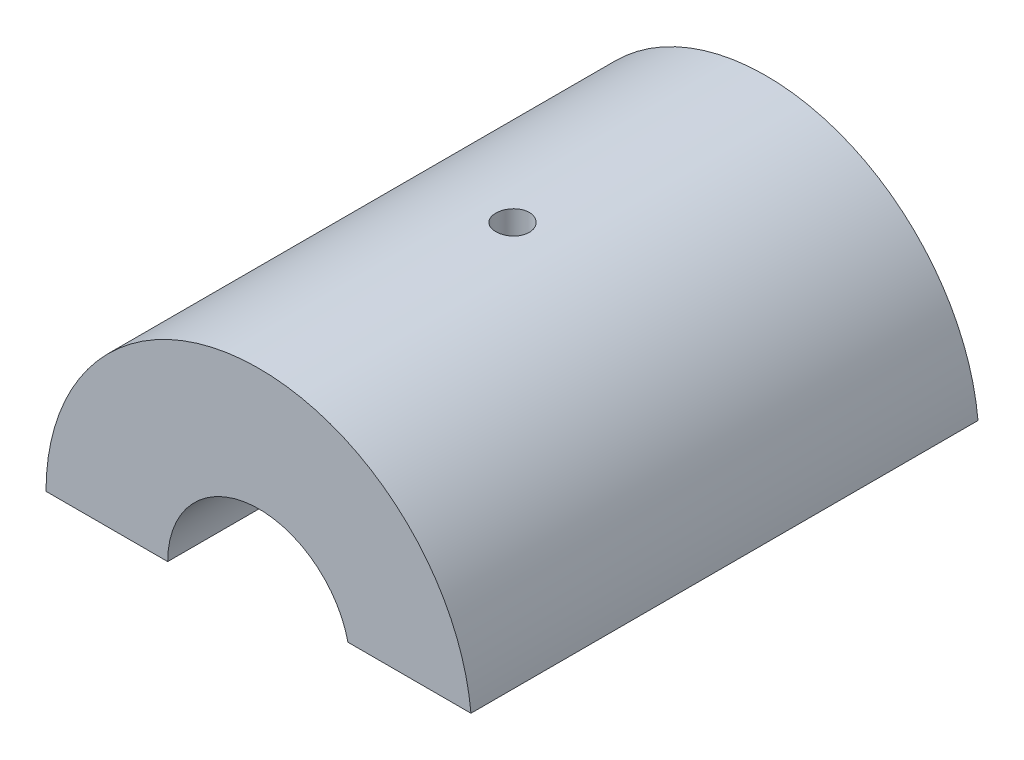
ISO-10303-21;
HEADER;
FILE_DESCRIPTION(('STEP AP214'),'2;1');
FILE_NAME('part.step','',(''),(''),'','','');
FILE_SCHEMA(('AUTOMOTIVE_DESIGN { 1 0 10303 214 1 1 1 1 }'));
ENDSEC;
DATA;
#1=APPLICATION_CONTEXT('core data for automotive mechanical design processes');
#2=APPLICATION_PROTOCOL_DEFINITION('international standard','automotive_design',2000,#1);
#3=PRODUCT_CONTEXT('',#1,'mechanical');
#4=PRODUCT('Part','Part','',(#3));
#5=PRODUCT_RELATED_PRODUCT_CATEGORY('part','',(#4));
#6=PRODUCT_DEFINITION_FORMATION('','',#4);
#7=PRODUCT_DEFINITION_CONTEXT('part definition',#1,'design');
#8=PRODUCT_DEFINITION('design','',#6,#7);
#9=PRODUCT_DEFINITION_SHAPE('','',#8);
#10=(LENGTH_UNIT() NAMED_UNIT(*) SI_UNIT(.MILLI.,.METRE.));
#11=(NAMED_UNIT(*) PLANE_ANGLE_UNIT() SI_UNIT($,.RADIAN.));
#12=(NAMED_UNIT(*) SI_UNIT($,.STERADIAN.) SOLID_ANGLE_UNIT());
#13=UNCERTAINTY_MEASURE_WITH_UNIT(LENGTH_MEASURE(1.E-05),#10,'distance_accuracy_value','');
#14=(GEOMETRIC_REPRESENTATION_CONTEXT(3) GLOBAL_UNCERTAINTY_ASSIGNED_CONTEXT((#13)) GLOBAL_UNIT_ASSIGNED_CONTEXT((#10,
#11,#12)) REPRESENTATION_CONTEXT('',''));
#15=CARTESIAN_POINT('',(0.,0.,0.));
#16=DIRECTION('',(0.,0.,1.));
#17=DIRECTION('',(1.,0.,0.));
#18=AXIS2_PLACEMENT_3D('',#15,#16,#17);
#19=CARTESIAN_POINT('',(0.,0.,50.));
#20=DIRECTION('',(0.,0.,-1.));
#21=DIRECTION('',(-1.,0.,0.));
#22=AXIS2_PLACEMENT_3D('',#19,#20,#21);
#23=CYLINDRICAL_SURFACE('',#22,9.);
#24=CARTESIAN_POINT('',(0.,9.,21.));
#25=CARTESIAN_POINT('',(-0.106543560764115,8.99999931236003,21.0000008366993));
#26=CARTESIAN_POINT('',(-0.213114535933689,8.99810295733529,21.004262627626));
#27=CARTESIAN_POINT('',(-0.42548775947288,8.99056534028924,21.0212664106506));
#28=CARTESIAN_POINT('',(-0.531289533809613,8.9849219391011,21.0340132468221));
#29=CARTESIAN_POINT('',(-0.741497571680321,8.97002203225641,21.0678848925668));
#30=CARTESIAN_POINT('',(-0.845900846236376,8.96075877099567,21.0890253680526));
#31=CARTESIAN_POINT('',(-1.0523739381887,8.93886560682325,21.1394527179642));
#32=CARTESIAN_POINT('',(-1.15444278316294,8.92623432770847,21.1687429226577));
#33=CARTESIAN_POINT('',(-1.45528706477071,8.88385509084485,21.268173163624));
#34=CARTESIAN_POINT('',(-1.64969223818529,8.84954694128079,21.3500354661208));
#35=CARTESIAN_POINT('',(-2.02169397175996,8.77205693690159,21.542157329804));
#36=CARTESIAN_POINT('',(-2.19929435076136,8.72887710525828,21.6524104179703));
#37=CARTESIAN_POINT('',(-2.54295194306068,8.63520005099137,21.904670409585));
#38=CARTESIAN_POINT('',(-2.70796463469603,8.58444255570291,22.048005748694));
#39=CARTESIAN_POINT('',(-3.01251193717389,8.48237167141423,22.3594860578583));
#40=CARTESIAN_POINT('',(-3.15203136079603,8.43105797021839,22.5276457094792));
#41=CARTESIAN_POINT('',(-3.40970641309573,8.33031613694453,22.8959209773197));
#42=CARTESIAN_POINT('',(-3.52616342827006,8.28116793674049,23.0973210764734));
#43=CARTESIAN_POINT('',(-3.67379855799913,8.21620901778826,23.4135583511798));
#44=CARTESIAN_POINT('',(-3.71851343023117,8.19601074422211,23.5213695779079));
#45=CARTESIAN_POINT('',(-3.79849956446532,8.15924882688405,23.7410191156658));
#46=CARTESIAN_POINT('',(-3.83377590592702,8.14268322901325,23.8528552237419));
#47=CARTESIAN_POINT('',(-3.89288163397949,8.11458487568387,24.0737900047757));
#48=CARTESIAN_POINT('',(-3.91721191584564,8.1028347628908,24.1827274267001));
#49=CARTESIAN_POINT('',(-3.95670961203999,8.08362129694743,24.4025783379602));
#50=CARTESIAN_POINT('',(-3.9718814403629,8.07615587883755,24.5134908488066));
#51=CARTESIAN_POINT('',(-3.99287182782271,8.06579894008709,24.7363722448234));
#52=CARTESIAN_POINT('',(-3.99869365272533,8.06290582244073,24.8483407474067));
#53=CARTESIAN_POINT('',(-4.00091360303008,8.06180452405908,25.0723891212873));
#54=CARTESIAN_POINT('',(-3.99731233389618,8.06359604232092,25.1844689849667));
#55=CARTESIAN_POINT('',(-3.98148137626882,8.07142338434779,25.3977271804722));
#56=CARTESIAN_POINT('',(-3.97005575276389,8.07706352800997,25.4989804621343));
#57=CARTESIAN_POINT('',(-3.9395760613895,8.09197245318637,25.7000710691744));
#58=CARTESIAN_POINT('',(-3.92051952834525,8.10124240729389,25.7999079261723));
#59=CARTESIAN_POINT('',(-3.85217674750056,8.13408651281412,26.0962376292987));
#60=CARTESIAN_POINT('',(-3.79170447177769,8.16270181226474,26.2897178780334));
#61=CARTESIAN_POINT('',(-3.64150006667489,8.23081734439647,26.6678984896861));
#62=CARTESIAN_POINT('',(-3.5511416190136,8.27054749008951,26.8523042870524));
#63=CARTESIAN_POINT('',(-3.34416344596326,8.35638151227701,27.2041434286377));
#64=CARTESIAN_POINT('',(-3.22753266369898,8.40248806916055,27.3715695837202));
#65=CARTESIAN_POINT('',(-2.95801583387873,8.50133279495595,27.701829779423));
#66=CARTESIAN_POINT('',(-2.80270476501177,8.55427944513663,27.8626276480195));
#67=CARTESIAN_POINT('',(-2.46687651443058,8.65709798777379,28.1566341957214));
#68=CARTESIAN_POINT('',(-2.28635173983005,8.70696894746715,28.2898345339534));
#69=CARTESIAN_POINT('',(-1.89830549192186,8.79984898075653,28.5284266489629));
#70=CARTESIAN_POINT('',(-1.69014406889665,8.84261183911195,28.6328807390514));
#71=CARTESIAN_POINT('',(-1.25681485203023,8.91451161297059,28.8045538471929));
#72=CARTESIAN_POINT('',(-1.03165788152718,8.94365711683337,28.8717963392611));
#73=CARTESIAN_POINT('',(-0.587641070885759,8.98336516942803,28.9626237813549));
#74=CARTESIAN_POINT('',(-0.369442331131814,8.99508492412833,28.9889334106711));
#75=CARTESIAN_POINT('',(0.0685540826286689,9.00240007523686,29.005406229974));
#76=CARTESIAN_POINT('',(0.288351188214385,8.9980009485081,28.9955816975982));
#77=CARTESIAN_POINT('',(0.709814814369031,8.97430591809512,28.9419129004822));
#78=CARTESIAN_POINT('',(0.911792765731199,8.95589038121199,28.9000783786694));
#79=CARTESIAN_POINT('',(1.30558421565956,8.90701082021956,28.7864838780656));
#80=CARTESIAN_POINT('',(1.49739647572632,8.87654533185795,28.7147202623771));
#81=CARTESIAN_POINT('',(1.87220783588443,8.80524764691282,28.5410228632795));
#82=CARTESIAN_POINT('',(2.05474529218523,8.76412168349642,28.4382176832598));
#83=CARTESIAN_POINT('',(2.40063957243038,8.67576208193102,28.2062947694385));
#84=CARTESIAN_POINT('',(2.56398799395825,8.62852578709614,28.0771655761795));
#85=CARTESIAN_POINT('',(2.88073032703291,8.52825739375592,27.7841760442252));
#86=CARTESIAN_POINT('',(3.03226090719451,8.4750650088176,27.6183553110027));
#87=CARTESIAN_POINT('',(3.30602071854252,8.37207677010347,27.2628521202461));
#88=CARTESIAN_POINT('',(3.42823956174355,8.32228212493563,27.0731612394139));
#89=CARTESIAN_POINT('',(3.58807434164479,8.25404075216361,26.771754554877));
#90=CARTESIAN_POINT('',(3.63788387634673,8.23214803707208,26.6671202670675));
#91=CARTESIAN_POINT('',(3.72840991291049,8.19154569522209,26.4534110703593));
#92=CARTESIAN_POINT('',(3.76913049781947,8.17283464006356,26.3443381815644));
#93=CARTESIAN_POINT('',(3.84101557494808,8.13929816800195,26.1225782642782));
#94=CARTESIAN_POINT('',(3.87218560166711,8.1244705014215,26.0098933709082));
#95=CARTESIAN_POINT('',(3.92460929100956,8.09927719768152,25.7817509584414));
#96=CARTESIAN_POINT('',(3.94586407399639,8.08891105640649,25.6662937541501));
#97=CARTESIAN_POINT('',(3.9767877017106,8.07374935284,25.4435206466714));
#98=CARTESIAN_POINT('',(3.98728755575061,8.06855529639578,25.3363465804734));
#99=CARTESIAN_POINT('',(3.99960939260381,8.06245450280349,25.1213401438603));
#100=CARTESIAN_POINT('',(4.00142848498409,8.06154919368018,25.0135075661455));
#101=CARTESIAN_POINT('',(3.99635429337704,8.06406616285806,24.7981559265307));
#102=CARTESIAN_POINT('',(3.98946605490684,8.06748593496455,24.690636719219));
#103=CARTESIAN_POINT('',(3.96708318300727,8.07851431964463,24.4767023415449));
#104=CARTESIAN_POINT('',(3.95158530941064,8.08612450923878,24.3702876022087));
#105=CARTESIAN_POINT('',(3.89481025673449,8.11370655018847,24.0667466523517));
#106=CARTESIAN_POINT('',(3.84284512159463,8.13866591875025,23.8719560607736));
#107=CARTESIAN_POINT('',(3.71108221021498,8.19957700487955,23.4940010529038));
#108=CARTESIAN_POINT('',(3.63127638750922,8.23553189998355,23.3108400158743));
#109=CARTESIAN_POINT('',(3.44024324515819,8.31722161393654,22.948335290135));
#110=CARTESIAN_POINT('',(3.32733013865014,8.36343549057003,22.7699883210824));
#111=CARTESIAN_POINT('',(3.0754694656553,8.45929191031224,22.4337467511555));
#112=CARTESIAN_POINT('',(2.93651102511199,8.5089358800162,22.2758607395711));
#113=CARTESIAN_POINT('',(2.622172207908,8.61126362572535,21.9707594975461));
#114=CARTESIAN_POINT('',(2.44466910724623,8.66383343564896,21.8256858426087));
#115=CARTESIAN_POINT('',(2.06586629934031,8.76186799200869,21.5671157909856));
#116=CARTESIAN_POINT('',(1.86455578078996,8.80732948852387,21.453633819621));
#117=CARTESIAN_POINT('',(1.55009155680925,8.86614466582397,21.3107804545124));
#118=CARTESIAN_POINT('',(1.4437611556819,8.88411858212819,21.267874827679));
#119=CARTESIAN_POINT('',(1.22735110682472,8.91658812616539,21.1912260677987));
#120=CARTESIAN_POINT('',(1.11727329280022,8.93108542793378,21.1574785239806));
#121=CARTESIAN_POINT('',(0.894475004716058,8.95614098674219,21.0995976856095));
#122=CARTESIAN_POINT('',(0.78176153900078,8.9667086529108,21.0754414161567));
#123=CARTESIAN_POINT('',(0.554414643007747,8.9836293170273,21.036933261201));
#124=CARTESIAN_POINT('',(0.439782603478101,8.98998524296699,21.0225745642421));
#125=CARTESIAN_POINT('',(0.270722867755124,8.99608997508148,21.00880385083));
#126=CARTESIAN_POINT('',(0.216644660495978,8.99755504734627,21.005503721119));
#127=CARTESIAN_POINT('',(0.108380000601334,8.99951024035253,21.0011015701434));
#128=CARTESIAN_POINT('',(0.0541935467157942,9.00000034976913,20.9999995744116));
#129=CARTESIAN_POINT('',(0.,9.,21.));
#130=B_SPLINE_CURVE_WITH_KNOTS('',3,(#24,#25,#26,#27,#28,#29,#30,#31,#32,#33,#34,#35,#36,#37,
#38,#39,#40,#41,#42,#43,#44,#45,#46,#47,#48,#49,#50,#51,#52,#53,#54,#55,#56,#57,#58,#59,#60,#61,
#62,#63,#64,#65,#66,#67,#68,#69,#70,#71,#72,#73,#74,#75,#76,#77,#78,#79,#80,#81,#82,#83,#84,#85,
#86,#87,#88,#89,#90,#91,#92,#93,#94,#95,#96,#97,#98,#99,#100,#101,#102,#103,#104,#105,#106,#107,
#108,#109,#110,#111,#112,#113,#114,#115,#116,#117,#118,#119,#120,#121,#122,#123,#124,#125,#126,
#127,#128,#129),.UNSPECIFIED.,.T.,.F.,(4,2,2,2,2,2,2,2,2,2,2,2,2,2,2,2,2,2,2,2,2,2,2,2,2,2,2,2,
2,2,2,2,2,2,2,2,2,2,2,2,2,2,2,2,2,2,2,2,2,2,2,2,4),(0.,0.319575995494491,0.639334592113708,
0.959692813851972,1.28018213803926,1.91817504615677,2.55602262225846,3.22626867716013,
3.89691272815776,4.6062783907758,4.96122462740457,5.31597945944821,5.65223953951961,
5.98833742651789,6.32431789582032,6.6602767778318,6.96605959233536,7.27194127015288,
7.88320420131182,8.50818797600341,9.13343527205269,9.81959120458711,10.5059542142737,
11.2125921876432,11.9187838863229,12.5755805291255,13.2321540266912,13.8505799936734,
14.4690811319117,15.1068781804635,15.7449534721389,16.4344546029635,17.1241997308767,
17.4776093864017,17.8308599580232,18.1839054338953,18.5369110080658,18.8599212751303,
19.183039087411,19.5059697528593,19.8290220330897,20.4355356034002,21.042224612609,
21.6877902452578,22.3336260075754,23.0359566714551,23.7386075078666,24.0863996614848,
24.4340240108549,24.7808105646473,25.1273557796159,25.2899067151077,25.4524595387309),.UNSPECIFIED.);
#131=CARTESIAN_POINT('',(0.,9.,21.));
#132=VERTEX_POINT('',#131);
#133=EDGE_CURVE('E104',#132,#132,#130,.T.);
#134=ORIENTED_EDGE('',*,*,#133,.T.);
#135=EDGE_LOOP('',(#134));
#136=FACE_BOUND('',#135,.T.);
#137=CARTESIAN_POINT('',(0.,0.,0.));
#138=DIRECTION('',(0.,0.,-1.));
#139=DIRECTION('',(1.,0.,0.));
#140=AXIS2_PLACEMENT_3D('',#137,#138,#139);
#141=CIRCLE('',#140,9.);
#142=CARTESIAN_POINT('',(-9.,0.,0.));
#143=VERTEX_POINT('',#142);
#144=CARTESIAN_POINT('',(8.77496438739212,2.,0.));
#145=VERTEX_POINT('',#144);
#146=EDGE_CURVE('E101',#143,#145,#141,.T.);
#147=ORIENTED_EDGE('',*,*,#146,.T.);
#148=DIRECTION('',(0.,0.,-1.));
#149=VECTOR('',#148,1.);
#150=CARTESIAN_POINT('',(8.77496438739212,2.,50.));
#151=LINE('',#150,#149);
#152=CARTESIAN_POINT('',(8.77496438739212,2.,50.));
#153=VERTEX_POINT('',#152);
#154=EDGE_CURVE('E43',#153,#145,#151,.T.);
#155=ORIENTED_EDGE('',*,*,#154,.F.);
#156=CARTESIAN_POINT('',(0.,0.,50.));
#157=DIRECTION('',(0.,0.,-1.));
#158=DIRECTION('',(1.,0.,0.));
#159=AXIS2_PLACEMENT_3D('',#156,#157,#158);
#160=CIRCLE('',#159,9.);
#161=CARTESIAN_POINT('',(-9.,0.,50.));
#162=VERTEX_POINT('',#161);
#163=EDGE_CURVE('E87',#162,#153,#160,.T.);
#164=ORIENTED_EDGE('',*,*,#163,.F.);
#165=DIRECTION('',(0.,0.,-1.));
#166=VECTOR('',#165,1.);
#167=CARTESIAN_POINT('',(-9.,0.,50.));
#168=LINE('',#167,#166);
#169=EDGE_CURVE('E97',#162,#143,#168,.T.);
#170=ORIENTED_EDGE('',*,*,#169,.T.);
#171=EDGE_LOOP('',(#147,#155,#164,#170));
#172=FACE_BOUND('',#171,.T.);
#173=ADVANCED_FACE('F30',(#136,#172),#23,.F.);
#174=CARTESIAN_POINT('',(8.77496438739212,2.,50.));
#175=DIRECTION('',(0.,1.,0.));
#176=DIRECTION('',(0.,0.,1.));
#177=AXIS2_PLACEMENT_3D('',#174,#175,#176);
#178=PLANE('',#177);
#179=DIRECTION('',(1.,0.,0.));
#180=VECTOR('',#179,1.);
#181=CARTESIAN_POINT('',(8.77496438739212,2.,0.));
#182=LINE('',#181,#180);
#183=CARTESIAN_POINT('',(20.9045449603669,2.,0.));
#184=VERTEX_POINT('',#183);
#185=EDGE_CURVE('E92',#145,#184,#182,.T.);
#186=ORIENTED_EDGE('',*,*,#185,.T.);
#187=DIRECTION('',(0.,0.,-1.));
#188=VECTOR('',#187,1.);
#189=CARTESIAN_POINT('',(20.9045449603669,2.,50.));
#190=LINE('',#189,#188);
#191=CARTESIAN_POINT('',(20.9045449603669,2.,50.));
#192=VERTEX_POINT('',#191);
#193=EDGE_CURVE('E90',#192,#184,#190,.T.);
#194=ORIENTED_EDGE('',*,*,#193,.F.);
#195=DIRECTION('',(1.,0.,0.));
#196=VECTOR('',#195,1.);
#197=CARTESIAN_POINT('',(8.77496438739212,2.,50.));
#198=LINE('',#197,#196);
#199=EDGE_CURVE('E82',#153,#192,#198,.T.);
#200=ORIENTED_EDGE('',*,*,#199,.F.);
#201=ORIENTED_EDGE('',*,*,#154,.T.);
#202=EDGE_LOOP('',(#186,#194,#200,#201));
#203=FACE_BOUND('',#202,.T.);
#204=ADVANCED_FACE('F91',(#203),#178,.F.);
#205=CARTESIAN_POINT('',(0.,0.,50.));
#206=DIRECTION('',(0.,0.,-1.));
#207=DIRECTION('',(-1.,0.,0.));
#208=AXIS2_PLACEMENT_3D('',#205,#206,#207);
#209=CYLINDRICAL_SURFACE('',#208,21.);
#210=CARTESIAN_POINT('',(0.,21.,23.35));
#211=CARTESIAN_POINT('',(0.0925281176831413,20.9999991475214,23.3500040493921));
#212=CARTESIAN_POINT('',(0.185119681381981,20.9993819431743,23.3578093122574));
#213=CARTESIAN_POINT('',(0.367742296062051,20.9969791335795,23.3888318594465));
#214=CARTESIAN_POINT('',(0.457770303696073,20.9951921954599,23.4120667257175));
#215=CARTESIAN_POINT('',(0.632594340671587,20.990651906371,23.4732735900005));
#216=CARTESIAN_POINT('',(0.717393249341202,20.987899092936,23.5112373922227));
#217=CARTESIAN_POINT('',(0.879394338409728,20.9817359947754,23.6008101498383));
#218=CARTESIAN_POINT('',(0.956598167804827,20.9783258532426,23.6524161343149));
#219=CARTESIAN_POINT('',(1.10141454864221,20.9712222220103,23.7679358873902));
#220=CARTESIAN_POINT('',(1.16900739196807,20.9675281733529,23.8318743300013));
#221=CARTESIAN_POINT('',(1.2925140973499,20.9602777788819,23.9701921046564));
#222=CARTESIAN_POINT('',(1.34842745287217,20.9567214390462,24.0445718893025));
#223=CARTESIAN_POINT('',(1.44705360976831,20.9501429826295,24.201778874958));
#224=CARTESIAN_POINT('',(1.48974926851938,20.9471215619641,24.2846168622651));
#225=CARTESIAN_POINT('',(1.56061852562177,20.9419612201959,24.456313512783));
#226=CARTESIAN_POINT('',(1.58879235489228,20.9398222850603,24.5451720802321));
#227=CARTESIAN_POINT('',(1.62976149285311,20.936673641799,24.7261914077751));
#228=CARTESIAN_POINT('',(1.64258868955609,20.9356615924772,24.8183449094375));
#229=CARTESIAN_POINT('',(1.65259893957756,20.9348738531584,25.0035020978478));
#230=CARTESIAN_POINT('',(1.64978225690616,20.9350981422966,25.0965057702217));
#231=CARTESIAN_POINT('',(1.62861108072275,20.9367556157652,25.2805050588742));
#232=CARTESIAN_POINT('',(1.61029120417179,20.9381861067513,25.3715046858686));
#233=CARTESIAN_POINT('',(1.55868743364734,20.9420905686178,25.5491333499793));
#234=CARTESIAN_POINT('',(1.52540340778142,20.9445645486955,25.6357623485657));
#235=CARTESIAN_POINT('',(1.44477725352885,20.9502803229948,25.8023012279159));
#236=CARTESIAN_POINT('',(1.39741955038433,20.9535229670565,25.8822035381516));
#237=CARTESIAN_POINT('',(1.29000159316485,20.9604098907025,26.0329381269));
#238=CARTESIAN_POINT('',(1.22994111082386,20.9640541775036,26.1037702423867));
#239=CARTESIAN_POINT('',(1.09862812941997,20.9713457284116,26.2345550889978));
#240=CARTESIAN_POINT('',(1.02734569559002,20.9749929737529,26.2944777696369));
#241=CARTESIAN_POINT('',(0.875716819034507,20.981870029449,26.4015105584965));
#242=CARTESIAN_POINT('',(0.795370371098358,20.9850998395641,26.4486206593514));
#243=CARTESIAN_POINT('',(0.62787500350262,20.9907786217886,26.5286889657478));
#244=CARTESIAN_POINT('',(0.540725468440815,20.9932275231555,26.5616458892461));
#245=CARTESIAN_POINT('',(0.362106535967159,20.9970677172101,26.6124515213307));
#246=CARTESIAN_POINT('',(0.270637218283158,20.998459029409,26.6303005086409));
#247=CARTESIAN_POINT('',(0.0862357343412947,21.0000247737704,26.6503460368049));
#248=CARTESIAN_POINT('',(-0.00669189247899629,21.000202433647,26.6525840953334));
#249=CARTESIAN_POINT('',(-0.191601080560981,20.9993294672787,26.6414529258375));
#250=CARTESIAN_POINT('',(-0.283582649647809,20.9982788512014,26.6280838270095));
#251=CARTESIAN_POINT('',(-0.463870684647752,20.9950695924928,26.5861522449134));
#252=CARTESIAN_POINT('',(-0.552181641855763,20.9929123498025,26.557608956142));
#253=CARTESIAN_POINT('',(-0.722760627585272,20.9877322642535,26.4861588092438));
#254=CARTESIAN_POINT('',(-0.805028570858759,20.9847094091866,26.4432517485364));
#255=CARTESIAN_POINT('',(-0.961375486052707,20.9781291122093,26.3441873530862));
#256=CARTESIAN_POINT('',(-1.0354369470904,20.9745705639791,26.2880024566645));
#257=CARTESIAN_POINT('',(-1.17309192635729,20.9673225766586,26.164017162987));
#258=CARTESIAN_POINT('',(-1.23668528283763,20.9636331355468,26.0962165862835));
#259=CARTESIAN_POINT('',(-1.3517408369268,20.9565296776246,25.9507446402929));
#260=CARTESIAN_POINT('',(-1.40317598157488,20.9531162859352,25.8730518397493));
#261=CARTESIAN_POINT('',(-1.49226968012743,20.9469600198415,25.7101077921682));
#262=CARTESIAN_POINT('',(-1.5299283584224,20.9442171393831,25.6248566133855));
#263=CARTESIAN_POINT('',(-1.59035385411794,20.9397158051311,25.4493123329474));
#264=CARTESIAN_POINT('',(-1.61313735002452,20.9379562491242,25.3590250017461));
#265=CARTESIAN_POINT('',(-1.64322008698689,20.9356169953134,25.1758920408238));
#266=CARTESIAN_POINT('',(-1.65051958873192,20.9350372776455,25.0830464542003));
#267=CARTESIAN_POINT('',(-1.64942426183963,20.9351235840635,24.8977013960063));
#268=CARTESIAN_POINT('',(-1.64107194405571,20.9357862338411,24.805201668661));
#269=CARTESIAN_POINT('',(-1.60899858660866,20.9382754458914,24.6229228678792));
#270=CARTESIAN_POINT('',(-1.58527752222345,20.9401020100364,24.5331437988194));
#271=CARTESIAN_POINT('',(-1.52315052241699,20.9447123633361,24.3588511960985));
#272=CARTESIAN_POINT('',(-1.48474521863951,20.9474961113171,24.2743374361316));
#273=CARTESIAN_POINT('',(-1.39434486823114,20.9537072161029,24.1129504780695));
#274=CARTESIAN_POINT('',(-1.34235006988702,20.9571345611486,24.0360771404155));
#275=CARTESIAN_POINT('',(-1.22608721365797,20.9642577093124,23.8919358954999));
#276=CARTESIAN_POINT('',(-1.16178779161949,20.9679541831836,23.8246933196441));
#277=CARTESIAN_POINT('',(-1.02279548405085,20.9751930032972,23.7019292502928));
#278=CARTESIAN_POINT('',(-0.948100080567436,20.9787353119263,23.6464106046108));
#279=CARTESIAN_POINT('',(-0.790307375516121,20.9852723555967,23.5486046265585));
#280=CARTESIAN_POINT('',(-0.707196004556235,20.9882661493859,23.5063399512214));
#281=CARTESIAN_POINT('',(-0.535090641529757,20.9933574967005,23.4364188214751));
#282=CARTESIAN_POINT('',(-0.44610357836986,20.9954560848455,23.4087454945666));
#283=CARTESIAN_POINT('',(-0.297155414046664,20.9979789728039,23.3758772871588));
#284=CARTESIAN_POINT('',(-0.23815353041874,20.9987334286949,23.3661861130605));
#285=CARTESIAN_POINT('',(-0.119443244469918,20.9997442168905,23.3532461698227));
#286=CARTESIAN_POINT('',(-0.0597348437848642,21.0000005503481,23.3499973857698));
#287=CARTESIAN_POINT('',(0.,21.,23.35));
#288=B_SPLINE_CURVE_WITH_KNOTS('',3,(#210,#211,#212,#213,#214,#215,#216,#217,#218,#219,#220,
#221,#222,#223,#224,#225,#226,#227,#228,#229,#230,#231,#232,#233,#234,#235,#236,#237,#238,#239,
#240,#241,#242,#243,#244,#245,#246,#247,#248,#249,#250,#251,#252,#253,#254,#255,#256,#257,#258,
#259,#260,#261,#262,#263,#264,#265,#266,#267,#268,#269,#270,#271,#272,#273,#274,#275,#276,#277,
#278,#279,#280,#281,#282,#283,#284,#285,#286,#287),.UNSPECIFIED.,.T.,.F.,(4,2,2,2,2,2,2,2,2,2,2,
2,2,2,2,2,2,2,2,2,2,2,2,2,2,2,2,2,2,2,2,2,2,2,2,2,2,2,4),(0.,0.277366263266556,
0.555049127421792,0.832577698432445,1.11004588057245,1.38807507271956,1.66611632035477,
1.94451667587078,2.22291260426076,2.50072905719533,2.77854082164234,3.05573389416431,
3.3329294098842,3.61043283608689,3.88794124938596,4.16620287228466,4.44446465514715,
4.72275163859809,5.001033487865,5.27857495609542,5.5561141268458,5.83330305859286,
6.11049589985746,6.38826926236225,6.66604691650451,6.94443694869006,7.22282446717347,
7.50089931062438,7.77896947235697,8.05628548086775,8.3336019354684,8.61090646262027,
8.8882059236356,9.16622186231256,9.44430525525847,9.72286145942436,10.0010948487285,
10.1801589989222,10.3592227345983),.UNSPECIFIED.);
#289=CARTESIAN_POINT('',(0.,21.,23.35));
#290=VERTEX_POINT('',#289);
#291=EDGE_CURVE('E11',#290,#290,#288,.T.);
#292=ORIENTED_EDGE('',*,*,#291,.T.);
#293=EDGE_LOOP('',(#292));
#294=FACE_BOUND('',#293,.T.);
#295=CARTESIAN_POINT('',(0.,0.,0.));
#296=DIRECTION('',(0.,0.,1.));
#297=DIRECTION('',(1.,0.,0.));
#298=AXIS2_PLACEMENT_3D('',#295,#296,#297);
#299=CIRCLE('',#298,21.);
#300=CARTESIAN_POINT('',(-21.,0.,0.));
#301=VERTEX_POINT('',#300);
#302=EDGE_CURVE('E68',#184,#301,#299,.T.);
#303=ORIENTED_EDGE('',*,*,#302,.T.);
#304=DIRECTION('',(0.,0.,-1.));
#305=VECTOR('',#304,1.);
#306=CARTESIAN_POINT('',(-21.,0.,50.));
#307=LINE('',#306,#305);
#308=CARTESIAN_POINT('',(-21.,0.,50.));
#309=VERTEX_POINT('',#308);
#310=EDGE_CURVE('E93',#309,#301,#307,.T.);
#311=ORIENTED_EDGE('',*,*,#310,.F.);
#312=CARTESIAN_POINT('',(0.,0.,50.));
#313=DIRECTION('',(0.,0.,1.));
#314=DIRECTION('',(1.,0.,0.));
#315=AXIS2_PLACEMENT_3D('',#312,#313,#314);
#316=CIRCLE('',#315,21.);
#317=EDGE_CURVE('E85',#192,#309,#316,.T.);
#318=ORIENTED_EDGE('',*,*,#317,.F.);
#319=ORIENTED_EDGE('',*,*,#193,.T.);
#320=EDGE_LOOP('',(#303,#311,#318,#319));
#321=FACE_BOUND('',#320,.T.);
#322=ADVANCED_FACE('F95',(#294,#321),#209,.T.);
#323=CARTESIAN_POINT('',(-9.,0.,50.));
#324=DIRECTION('',(0.,1.,0.));
#325=DIRECTION('',(0.,0.,1.));
#326=AXIS2_PLACEMENT_3D('',#323,#324,#325);
#327=PLANE('',#326);
#328=DIRECTION('',(1.,0.,0.));
#329=VECTOR('',#328,1.);
#330=CARTESIAN_POINT('',(-9.,0.,0.));
#331=LINE('',#330,#329);
#332=EDGE_CURVE('E74',#301,#143,#331,.T.);
#333=ORIENTED_EDGE('',*,*,#332,.T.);
#334=ORIENTED_EDGE('',*,*,#169,.F.);
#335=DIRECTION('',(1.,0.,0.));
#336=VECTOR('',#335,1.);
#337=CARTESIAN_POINT('',(-9.,0.,50.));
#338=LINE('',#337,#336);
#339=EDGE_CURVE('E51',#309,#162,#338,.T.);
#340=ORIENTED_EDGE('',*,*,#339,.F.);
#341=ORIENTED_EDGE('',*,*,#310,.T.);
#342=EDGE_LOOP('',(#333,#334,#340,#341));
#343=FACE_BOUND('',#342,.T.);
#344=ADVANCED_FACE('F125',(#343),#327,.F.);
#345=CARTESIAN_POINT('',(0.,0.,50.));
#346=DIRECTION('',(0.,0.,1.));
#347=DIRECTION('',(1.,0.,0.));
#348=AXIS2_PLACEMENT_3D('',#345,#346,#347);
#349=PLANE('',#348);
#350=ORIENTED_EDGE('',*,*,#163,.T.);
#351=ORIENTED_EDGE('',*,*,#199,.T.);
#352=ORIENTED_EDGE('',*,*,#317,.T.);
#353=ORIENTED_EDGE('',*,*,#339,.T.);
#354=EDGE_LOOP('',(#350,#351,#352,#353));
#355=FACE_BOUND('',#354,.T.);
#356=ADVANCED_FACE('F83',(#355),#349,.T.);
#357=CARTESIAN_POINT('',(0.,0.,0.));
#358=DIRECTION('',(0.,0.,1.));
#359=DIRECTION('',(1.,0.,0.));
#360=AXIS2_PLACEMENT_3D('',#357,#358,#359);
#361=PLANE('',#360);
#362=ORIENTED_EDGE('',*,*,#146,.F.);
#363=ORIENTED_EDGE('',*,*,#332,.F.);
#364=ORIENTED_EDGE('',*,*,#302,.F.);
#365=ORIENTED_EDGE('',*,*,#185,.F.);
#366=EDGE_LOOP('',(#362,#363,#364,#365));
#367=FACE_BOUND('',#366,.T.);
#368=ADVANCED_FACE('F121',(#367),#361,.F.);
#369=CARTESIAN_POINT('',(0.,17.,25.));
#370=DIRECTION('',(0.,-1.,0.));
#371=DIRECTION('',(0.,0.,-1.));
#372=AXIS2_PLACEMENT_3D('',#369,#370,#371);
#373=CYLINDRICAL_SURFACE('',#372,4.);
#374=CARTESIAN_POINT('',(0.,17.,25.));
#375=DIRECTION('',(0.,-1.,0.));
#376=DIRECTION('',(0.,0.,-1.));
#377=AXIS2_PLACEMENT_3D('',#374,#375,#376);
#378=CIRCLE('',#377,4.);
#379=CARTESIAN_POINT('',(0.,17.,21.));
#380=VERTEX_POINT('',#379);
#381=EDGE_CURVE('E114',#380,#380,#378,.T.);
#382=ORIENTED_EDGE('',*,*,#381,.F.);
#383=EDGE_LOOP('',(#382));
#384=FACE_BOUND('',#383,.T.);
#385=ORIENTED_EDGE('',*,*,#133,.F.);
#386=EDGE_LOOP('',(#385));
#387=FACE_BOUND('',#386,.T.);
#388=ADVANCED_FACE('F115',(#384,#387),#373,.F.);
#389=CARTESIAN_POINT('',(0.,17.,25.));
#390=DIRECTION('',(0.,-1.,0.));
#391=DIRECTION('',(0.,0.,-1.));
#392=AXIS2_PLACEMENT_3D('',#389,#390,#391);
#393=PLANE('',#392);
#394=CARTESIAN_POINT('',(0.,17.,25.));
#395=DIRECTION('',(0.,-1.,0.));
#396=DIRECTION('',(0.,0.,-1.));
#397=AXIS2_PLACEMENT_3D('',#394,#395,#396);
#398=CIRCLE('',#397,1.65);
#399=CARTESIAN_POINT('',(0.,17.,23.35));
#400=VERTEX_POINT('',#399);
#401=EDGE_CURVE('E146',#400,#400,#398,.T.);
#402=ORIENTED_EDGE('',*,*,#401,.F.);
#403=EDGE_LOOP('',(#402));
#404=FACE_BOUND('',#403,.T.);
#405=ORIENTED_EDGE('',*,*,#381,.T.);
#406=EDGE_LOOP('',(#405));
#407=FACE_BOUND('',#406,.T.);
#408=ADVANCED_FACE('F120',(#404,#407),#393,.T.);
#409=CARTESIAN_POINT('',(0.,17.,25.));
#410=DIRECTION('',(0.,-1.,0.));
#411=DIRECTION('',(0.,0.,-1.));
#412=AXIS2_PLACEMENT_3D('',#409,#410,#411);
#413=CYLINDRICAL_SURFACE('',#412,1.65);
#414=ORIENTED_EDGE('',*,*,#401,.T.);
#415=EDGE_LOOP('',(#414));
#416=FACE_BOUND('',#415,.T.);
#417=ORIENTED_EDGE('',*,*,#291,.F.);
#418=EDGE_LOOP('',(#417));
#419=FACE_BOUND('',#418,.T.);
#420=ADVANCED_FACE('F150',(#416,#419),#413,.F.);
#421=CLOSED_SHELL('',(#173,#204,#322,#344,#356,#368,#388,#408,#420));
#422=MANIFOLD_SOLID_BREP('B2',#421);
#423=ADVANCED_BREP_SHAPE_REPRESENTATION('',(#18,#422),#14);
#424=SHAPE_DEFINITION_REPRESENTATION(#9,#423);
ENDSEC;
END-ISO-10303-21;
